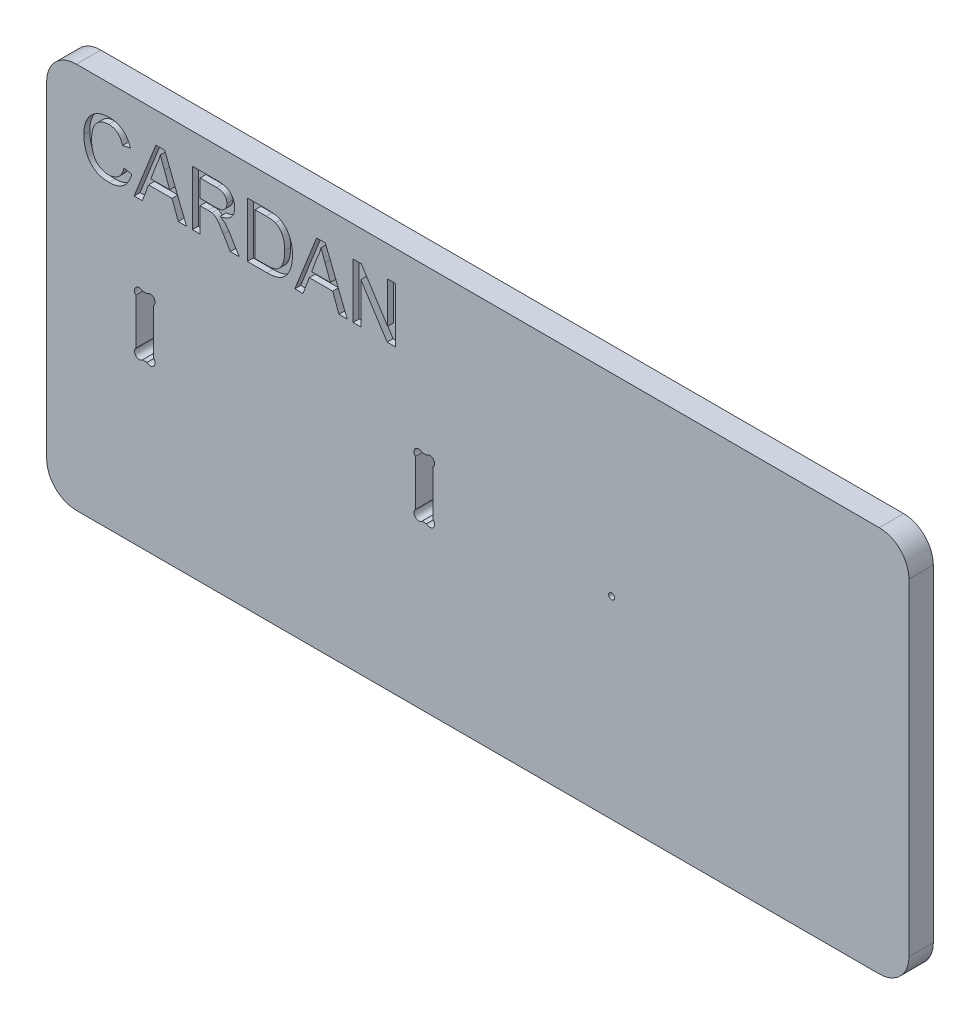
from build123d import *

# Parameters (mm, degrees)
EXTRUSION1_DEPTH        = 8.2
ESQUISSE2_R             = 1
ENL_V_MAT_EXTRU_1_DEPTH = 2


with BuildPart() as part:
    # Esquisse1 → Extrusion1 (new body)
    with BuildSketch(Plane.XY):
        with BuildLine():
            Line((10, 165), (280, 165))
            ThreePointArc((280, 165), (287.071067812, 162.071067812), (290, 155))
            Line((290, 155), (290, 45))
            ThreePointArc((290, 45), (287.071067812, 37.928932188), (280, 35))
            Line((280, 35), (10, 35))
            ThreePointArc((10, 35), (2.928932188, 37.928932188), (0, 45))
            Line((0, 45), (0, 155))
            ThreePointArc((0, 155), (2.928932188, 162.071067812), (10, 165))
        make_face()
        with BuildLine():
            Line((127.7372583, 90), (126.2627417, 90))
            ThreePointArc((126.2627417, 90), (124, 90), (124, 92.2627417))
            Line((124, 92.2627417), (124, 107.7372583))
            ThreePointArc((124, 107.7372583), (124, 110), (126.2627417, 110))
            Line((126.2627417, 110), (127.7372583, 110))
            ThreePointArc((127.7372583, 110), (130, 110), (130, 107.7372583))
            Line((130, 107.7372583), (130, 92.2627417))
            ThreePointArc((130, 92.2627417), (130, 90), (127.7372583, 90))
        make_face(mode=Mode.SUBTRACT)
        with BuildLine():
            Line((32.2627417, 110), (33.7372583, 110))
            ThreePointArc((33.7372583, 110), (36, 110), (36, 107.7372583))
            Line((36, 107.7372583), (36, 92.2627417))
            ThreePointArc((36, 92.2627417), (36, 90), (33.7372583, 90))
            Line((33.7372583, 90), (32.2627417, 90))
            ThreePointArc((32.2627417, 90), (30, 90), (30, 92.2627417))
            Line((30, 92.2627417), (30, 107.7372583))
            ThreePointArc((30, 107.7372583), (30, 110), (32.2627417, 110))
        make_face(mode=Mode.SUBTRACT)
    extrude(amount=EXTRUSION1_DEPTH)

    # Esquisse2 → Enl_v. mat.-Extru.1 (cut)
    # profile 1 of 7: a face of its own
    with BuildSketch(Plane.XY.offset(8.2)):
        with Locations((190, 100)):
            Circle(ESQUISSE2_R)
    # profile 2 of 7: a face of its own
    with BuildSketch(Plane.XY.offset(8.2)):
        with BuildLine():
            Line((26.000996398, 142.805266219), (28.608827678, 142.197760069))
            add(Edge.make_bspline(
                [(28.608827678, 142.197760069), (28.543494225, 141.953335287), (28.415693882, 141.475210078), (28.163017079, 140.790959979), (27.879418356, 140.148820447), (27.558016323, 139.550482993), (27.195293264, 138.999387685), (26.800859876, 138.488451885), (26.359093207, 138.028390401), (25.886202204, 137.608585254), (25.378504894, 137.238318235), (24.842122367, 136.918585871), (24.279647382, 136.646558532), (23.688806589, 136.422859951), (23.069216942, 136.25450759), (22.424068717, 136.131802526), (21.751480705, 136.056223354), (21.293021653, 136.046273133), (21.059452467, 136.041203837)],
                knots=[0, 0, 0, 0, 1.145254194, 2.240259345, 3.299159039, 4.322497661, 5.312016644, 6.284080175, 7.241264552, 8.196044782, 9.144516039, 10.082428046, 11.020306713, 11.970622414, 12.939253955, 13.924100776, 14.94240044, 16, 16, 16, 16], degree=3))
            add(Edge.make_bspline(
                [(21.059452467, 136.041203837), (20.819805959, 136.04468547), (20.350956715, 136.051497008), (19.664119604, 136.106900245), (19.010870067, 136.202988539), (18.392428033, 136.336489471), (17.8067119, 136.501555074), (17.256150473, 136.70922223), (16.741708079, 136.957992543), (16.259093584, 137.240908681), (15.810356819, 137.562314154), (15.38529335, 137.913535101), (14.994222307, 138.304240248), (14.627365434, 138.725204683), (14.292713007, 139.181981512), (13.977953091, 139.668365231), (13.698448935, 140.192925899), (13.443842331, 140.745938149), (13.220368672, 141.322047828), (13.022672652, 141.909875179), (12.861045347, 142.510591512), (12.721894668, 143.119141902), (12.620808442, 143.740646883), (12.540549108, 144.370443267), (12.496420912, 145.012392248), (12.490614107, 145.443905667), (12.487688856, 145.661285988)],
                knots=[0, 0, 0, 0, 1.180702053, 2.309949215, 3.392367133, 4.431746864, 5.425408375, 6.388154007, 7.326956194, 8.237882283, 9.141054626, 10.043899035, 10.951650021, 11.86168169, 12.792564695, 13.739356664, 14.713891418, 15.718426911, 16.737522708, 17.757217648, 18.772674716, 19.801476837, 20.831699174, 21.873853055, 22.928926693, 24, 24, 24, 24], degree=3))
            add(Edge.make_bspline(
                [(12.487688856, 145.661285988), (12.491872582, 145.89595681), (12.500138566, 146.359607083), (12.546799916, 147.043736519), (12.632499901, 147.704005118), (12.751512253, 148.34084719), (12.90211049, 148.954778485), (13.088007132, 149.546098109), (13.306850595, 150.114049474), (13.557973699, 150.659258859), (13.843044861, 151.175640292), (14.153555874, 151.66392785), (14.496913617, 152.116104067), (14.862938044, 152.540807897), (15.260770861, 152.930967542), (15.689197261, 153.287466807), (16.144520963, 153.613557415), (16.626675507, 153.906212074), (17.129358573, 154.163001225), (17.645103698, 154.39172556), (18.17596222, 154.579196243), (18.717725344, 154.73507058), (19.271559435, 154.859161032), (19.838758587, 154.942140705), (20.418798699, 154.996216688), (20.809907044, 155.003545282), (21.007592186, 155.00724951)],
                knots=[0, 0, 0, 0, 1.185634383, 2.342514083, 3.462112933, 4.547331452, 5.613960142, 6.653690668, 7.676612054, 8.686959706, 9.683658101, 10.654407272, 11.607580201, 12.5494388, 13.484601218, 14.419076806, 15.362504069, 16.311442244, 17.265594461, 18.212500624, 19.159571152, 20.107257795, 21.059246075, 22.024387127, 23.001429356, 24, 24, 24, 24], degree=3))
            add(Edge.make_bspline(
                [(21.007592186, 155.00724951), (21.228775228, 155.003080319), (21.663532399, 154.994885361), (22.301461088, 154.927480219), (22.912430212, 154.814583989), (23.499087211, 154.666474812), (24.055332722, 154.463682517), (24.587205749, 154.222585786), (25.08941521, 153.932937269), (25.565868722, 153.60269703), (26.008810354, 153.23125603), (26.424438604, 152.827487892), (26.795806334, 152.381301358), (27.137621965, 151.903494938), (27.439130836, 151.387443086), (27.711425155, 150.837645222), (27.945590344, 150.250014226), (28.070880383, 149.840712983), (28.134676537, 149.6323018)],
                knots=[0, 0, 0, 0, 1.098391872, 2.158997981, 3.181470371, 4.182549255, 5.160268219, 6.118029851, 7.079534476, 8.035645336, 8.993622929, 9.94770573, 10.909620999, 11.872786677, 12.862530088, 13.874594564, 14.917769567, 16, 16, 16, 16], degree=3))
            Line((28.134676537, 149.6323018), (25.526845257, 149.072951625))
            add(Edge.make_bspline(
                [(25.526845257, 149.072951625), (25.475631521, 149.232896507), (25.375390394, 149.545958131), (25.197402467, 149.992126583), (25.00518144, 150.406316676), (24.794148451, 150.785712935), (24.563846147, 151.130406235), (24.319577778, 151.444585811), (24.055490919, 151.722387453), (23.776957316, 151.970216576), (23.476784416, 152.181343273), (23.162009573, 152.368436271), (22.825995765, 152.523227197), (22.473576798, 152.654148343), (22.101458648, 152.753793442), (21.71115663, 152.8238977), (21.302327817, 152.86447061), (21.023733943, 152.870496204), (20.881645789, 152.873569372)],
                knots=[0, 0, 0, 0, 1.235697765, 2.418642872, 3.532555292, 4.594392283, 5.610119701, 6.580908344, 7.519430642, 8.427315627, 9.319973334, 10.216139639, 11.118687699, 12.038725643, 12.980015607, 13.949697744, 14.954307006, 16, 16, 16, 16], degree=3))
            add(Edge.make_bspline(
                [(20.881645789, 152.873569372), (20.71851559, 152.871202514), (20.397686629, 152.866547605), (19.92635029, 152.815600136), (19.473703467, 152.740559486), (19.04311972, 152.62802958), (18.632242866, 152.487734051), (18.243511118, 152.313041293), (17.873617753, 152.10828089), (17.526690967, 151.872223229), (17.205646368, 151.606848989), (16.901771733, 151.326306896), (16.629656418, 151.017513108), (16.378923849, 150.690649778), (16.15687535, 150.339940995), (15.956994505, 149.970163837), (15.7805554, 149.57828769), (15.588224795, 149.026751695), (15.392117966, 148.316386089), (15.221995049, 147.44712883), (15.113630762, 146.564176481), (15.101569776, 145.97028664), (15.095520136, 145.672398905)],
                knots=[0, 0, 0, 0, 0.935256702, 1.839373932, 2.716087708, 3.564631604, 4.388828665, 5.203538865, 6.005592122, 6.810952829, 7.606223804, 8.392839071, 9.180346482, 9.963639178, 10.753404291, 11.558266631, 12.372976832, 13.215232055, 14.905983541, 16.594894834, 18.292041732, 20, 20, 20, 20], degree=3))
            add(Edge.make_bspline(
                [(15.095520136, 145.672398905), (15.102343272, 145.29785493), (15.115580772, 144.5712057), (15.246202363, 143.518170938), (15.44535289, 142.53597295), (15.685698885, 141.769662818), (15.926790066, 141.204418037), (16.1217725, 140.808568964), (16.344337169, 140.442269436), (16.58894808, 140.103439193), (16.858756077, 139.793066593), (17.150002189, 139.509502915), (17.462751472, 139.250019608), (17.800709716, 139.026763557), (18.150868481, 138.828531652), (18.508809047, 138.652260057), (18.874756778, 138.503177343), (19.250188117, 138.387366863), (19.629831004, 138.287290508), (20.017866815, 138.221915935), (20.414184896, 138.185020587), (20.680302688, 138.178289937), (20.814968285, 138.174883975)],
                knots=[0, 0, 0, 0, 2.10686522, 4.087509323, 5.961373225, 7.741398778, 8.594514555, 9.418024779, 10.222433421, 11.003575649, 11.767087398, 12.533660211, 13.289033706, 14.050297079, 14.809623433, 15.552362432, 16.294320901, 17.0305302, 17.761969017, 18.502233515, 19.242073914, 20, 20, 20, 20], degree=3))
            add(Edge.make_bspline(
                [(20.814968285, 138.174883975), (20.975673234, 138.178254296), (21.293122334, 138.184911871), (21.758543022, 138.243186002), (22.207202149, 138.329060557), (22.633664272, 138.461573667), (23.04366579, 138.623820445), (23.433847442, 138.823899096), (23.802982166, 139.064535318), (24.1554118, 139.337755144), (24.484637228, 139.648632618), (24.786354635, 139.994663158), (25.057029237, 140.377424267), (25.308012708, 140.790773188), (25.518884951, 141.247058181), (25.71420244, 141.732679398), (25.87695508, 142.255618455), (25.959055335, 142.619418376), (26.000996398, 142.805266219)],
                knots=[0, 0, 0, 0, 1.013374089, 2.001772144, 2.95501459, 3.891367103, 4.814208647, 5.733921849, 6.652182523, 7.590185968, 8.54346024, 9.504121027, 10.481158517, 11.497760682, 12.549996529, 13.647863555, 14.798406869, 16, 16, 16, 16], degree=3))
        make_face()
    # profile 3 of 7: a face of its own
    with BuildSketch(Plane.XY.offset(8.2)):
        Polygon((29.397844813, 136.278279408), (36.7397789, 154.770173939), (39.680997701, 154.770173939), (47.022931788, 136.278279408), (44.255815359, 136.278279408), (42.151769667, 141.96809311), (34.269006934, 141.96809311), (32.164961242, 136.278279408), align=None)
        with BuildLine():
            Line((35.054319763, 144.101773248), (41.366456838, 144.101773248))
            Line((41.366456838, 144.101773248), (39.569868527, 148.961822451))
            add(Edge.make_bspline(
                [(39.569868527, 148.961822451), (39.500993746, 149.14960813), (39.366330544, 149.516764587), (39.165507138, 150.050211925), (38.982038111, 150.556795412), (38.802131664, 151.029251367), (38.639726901, 151.474442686), (38.490034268, 151.889362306), (38.341989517, 152.271126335), (38.25314578, 152.517785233), (38.2103883, 152.636493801)],
                knots=[0, 0, 0, 0, 1.225184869, 2.395467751, 3.491410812, 4.525364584, 5.492066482, 6.394148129, 7.227157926, 8, 8, 8, 8], degree=3))
            add(Edge.make_bspline(
                [(38.2103883, 152.636493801), (38.139659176, 152.343768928), (37.99790929, 151.757112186), (37.701119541, 150.897581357), (37.361602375, 150.045911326), (37.08587398, 149.497100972), (36.947220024, 149.221123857)],
                knots=[0, 0, 0, 0, 0.9891762, 1.982431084, 2.985436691, 4, 4, 4, 4], degree=3))
            Line((36.947220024, 149.221123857), (35.054319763, 144.101773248))
        make_face(mode=Mode.SUBTRACT)
    # profile 4 of 7: a face of its own
    with BuildSketch(Plane.XY.offset(8.2)):
        with BuildLine():
            Line((48.997326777, 136.278279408), (48.997326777, 154.770173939))
            Line((48.997326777, 154.770173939), (57.02085313, 154.770173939))
            add(Edge.make_bspline(
                [(57.02085313, 154.770173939), (57.209782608, 154.768693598), (57.575433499, 154.765828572), (58.105702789, 154.745547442), (58.600656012, 154.701826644), (59.061203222, 154.654548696), (59.487262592, 154.581983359), (59.878394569, 154.498752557), (60.23520304, 154.399706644), (60.559283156, 154.282725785), (60.859958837, 154.150379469), (61.138662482, 153.987085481), (61.406979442, 153.808150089), (61.654951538, 153.597927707), (61.889119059, 153.367753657), (62.109264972, 153.114500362), (62.31213019, 152.835970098), (62.562340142, 152.437335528), (62.830764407, 151.906438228), (63.054403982, 151.227004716), (63.198602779, 150.516292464), (63.214032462, 150.030602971), (63.221861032, 149.784178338)],
                knots=[0, 0, 0, 0, 1.242255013, 2.404239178, 3.487702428, 4.508875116, 5.447164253, 6.327763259, 7.137389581, 7.87956647, 8.591787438, 9.293660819, 10.000726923, 10.709654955, 11.427269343, 12.158170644, 12.913245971, 13.690346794, 15.251572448, 16.809945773, 18.381459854, 20, 20, 20, 20], degree=3))
            add(Edge.make_bspline(
                [(63.221861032, 149.784178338), (63.218242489, 149.6259957), (63.21109562, 149.313574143), (63.15634988, 148.854230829), (63.057291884, 148.415346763), (62.930269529, 147.993078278), (62.756414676, 147.593408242), (62.555011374, 147.208173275), (62.305501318, 146.847956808), (62.026147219, 146.503166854), (61.70580298, 146.181187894), (61.34165054, 145.893636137), (60.937299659, 145.634982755), (60.490846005, 145.412364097), (60.00742871, 145.208880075), (59.480982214, 145.045024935), (58.913631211, 144.911224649), (58.520317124, 144.846433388), (58.317360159, 144.81299996)],
                knots=[0, 0, 0, 0, 0.982609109, 1.940720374, 2.867584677, 3.775009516, 4.675469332, 5.571146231, 6.471115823, 7.392408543, 8.32534739, 9.286126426, 10.269214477, 11.301811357, 12.381622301, 13.524260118, 14.722474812, 16, 16, 16, 16], degree=3))
            add(Edge.make_bspline(
                [(58.317360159, 144.81299996), (58.466236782, 144.737790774), (58.748958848, 144.594965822), (59.140391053, 144.371017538), (59.472194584, 144.142197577), (59.664425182, 143.978538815), (59.754630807, 143.901740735)],
                knots=[0, 0, 0, 0, 1.172304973, 2.226249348, 3.167654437, 4, 4, 4, 4], degree=3))
            add(Edge.make_bspline(
                [(59.754630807, 143.901740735), (59.929319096, 143.730495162), (60.288141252, 143.378744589), (60.782613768, 142.779610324), (61.262021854, 142.112681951), (61.553298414, 141.630690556), (61.703095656, 141.382812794)],
                knots=[0, 0, 0, 0, 0.918110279, 1.885863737, 2.912745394, 4, 4, 4, 4], degree=3))
            Line((61.703095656, 141.382812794), (64.736922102, 136.278279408))
            Line((64.736922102, 136.278279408), (61.747547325, 136.278279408))
            Line((61.747547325, 136.278279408), (59.44346912, 140.182617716))
            add(Edge.make_bspline(
                [(59.44346912, 140.182617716), (59.360626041, 140.319606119), (59.200089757, 140.585067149), (58.968200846, 140.972760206), (58.740841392, 141.329693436), (58.529969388, 141.666068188), (58.327027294, 141.975777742), (58.133976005, 142.259897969), (57.956128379, 142.522156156), (57.735841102, 142.827492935), (57.479463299, 143.165350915), (57.180287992, 143.513280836), (56.895384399, 143.790680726), (56.544520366, 144.062700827), (56.109922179, 144.317129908), (55.740505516, 144.434033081), (55.561356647, 144.490725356)],
                knots=[0, 0, 0, 0, 1.130940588, 2.191577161, 3.191089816, 4.120344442, 4.99615009, 5.80661983, 6.546979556, 7.234477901, 8.466216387, 9.541989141, 10.473533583, 11.269175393, 12.675684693, 14, 14, 14, 14], degree=3))
            add(Edge.make_bspline(
                [(55.561356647, 144.490725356), (55.486192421, 144.504280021), (55.31459024, 144.535225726), (55.023210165, 144.555436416), (54.670167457, 144.576887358), (54.41431139, 144.57626235), (54.275962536, 144.57592439)],
                knots=[0, 0, 0, 0, 0.709978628, 1.620902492, 2.713552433, 4, 4, 4, 4], degree=3))
            Line((54.275962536, 144.57592439), (51.605158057, 144.57592439))
            Line((51.605158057, 144.57592439), (51.605158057, 136.278279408))
            Line((51.605158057, 136.278279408), (48.997326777, 136.278279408))
        make_face()
        with BuildLine():
            Line((51.605158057, 146.709604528), (56.557814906, 146.709604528))
            add(Edge.make_bspline(
                [(56.557814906, 146.709604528), (56.80615988, 146.71349012), (57.270417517, 146.720753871), (57.919608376, 146.78277867), (58.472863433, 146.88133871), (58.941119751, 147.02510007), (59.334528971, 147.224688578), (59.676684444, 147.467924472), (59.961019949, 147.772602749), (60.197557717, 148.116367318), (60.381423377, 148.494663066), (60.514055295, 148.892007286), (60.600865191, 149.305060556), (60.609602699, 149.586178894), (60.614029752, 149.728613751)],
                knots=[0, 0, 0, 0, 1.546323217, 2.890706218, 4.056530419, 5.041445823, 5.928701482, 6.793137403, 7.641659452, 8.509781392, 9.383301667, 10.251423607, 11.114044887, 12, 12, 12, 12], degree=3))
            add(Edge.make_bspline(
                [(60.614029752, 149.728613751), (60.610587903, 149.832411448), (60.603846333, 150.035720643), (60.568504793, 150.334122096), (60.499792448, 150.617672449), (60.409057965, 150.887870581), (60.287818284, 151.142737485), (60.143790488, 151.384248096), (59.971920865, 151.611063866), (59.775054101, 151.82387571), (59.54901528, 152.017513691), (59.290825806, 152.18458127), (59.002522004, 152.326552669), (58.683768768, 152.439230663), (58.335570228, 152.529354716), (57.955944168, 152.589311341), (57.546626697, 152.632695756), (57.262993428, 152.635204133), (57.117165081, 152.636493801)],
                knots=[0, 0, 0, 0, 0.965208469, 1.890559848, 2.786986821, 3.67262109, 4.535197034, 5.405224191, 6.282113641, 7.175449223, 8.095446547, 9.040936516, 10.026471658, 11.075712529, 12.17809725, 13.364958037, 14.645208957, 16, 16, 16, 16], degree=3))
            Line((57.117165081, 152.636493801), (51.605158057, 152.636493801))
            Line((51.605158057, 152.636493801), (51.605158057, 146.709604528))
        make_face(mode=Mode.SUBTRACT)
    # profile 5 of 7: a face of its own
    with BuildSketch(Plane.XY.offset(8.2)):
        with BuildLine():
            Line((67.489221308, 136.278279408), (67.489221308, 154.770173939))
            Line((67.489221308, 154.770173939), (73.812471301, 154.770173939))
            add(Edge.make_bspline(
                [(73.812471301, 154.770173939), (73.985340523, 154.769392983), (74.321238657, 154.767875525), (74.809164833, 154.758204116), (75.266042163, 154.734876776), (75.689765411, 154.70646099), (76.082471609, 154.668627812), (76.443659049, 154.6263209), (76.773609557, 154.571137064), (76.981053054, 154.525269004), (77.079669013, 154.503463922)],
                knots=[0, 0, 0, 0, 1.263127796, 2.454354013, 3.565393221, 4.605443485, 5.557051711, 6.447822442, 7.26211484, 8, 8, 8, 8], degree=3))
            add(Edge.make_bspline(
                [(77.079669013, 154.503463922), (77.334706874, 154.436551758), (77.83575367, 154.305096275), (78.543033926, 154.009404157), (79.192347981, 153.638512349), (79.577432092, 153.333004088), (79.76899502, 153.181026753)],
                knots=[0, 0, 0, 0, 1.04477941, 2.052571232, 3.03123721, 4, 4, 4, 4], degree=3))
            add(Edge.make_bspline(
                [(79.76899502, 153.181026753), (79.887935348, 153.076577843), (80.126354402, 152.867207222), (80.453821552, 152.522253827), (80.757607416, 152.156314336), (81.046785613, 151.775688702), (81.302860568, 151.366500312), (81.542894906, 150.940526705), (81.752262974, 150.489213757), (81.944983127, 150.019937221), (82.116683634, 149.530868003), (82.257763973, 149.022321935), (82.387371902, 148.49960946), (82.483770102, 147.957016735), (82.567920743, 147.399146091), (82.621341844, 146.822804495), (82.656003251, 146.229712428), (82.660019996, 145.828031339), (82.662057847, 145.62424293)],
                knots=[0, 0, 0, 0, 0.908997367, 1.822109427, 2.728529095, 3.640759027, 4.565643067, 5.499218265, 6.448003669, 7.421473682, 8.413047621, 9.423472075, 10.452328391, 11.505545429, 12.587978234, 13.692612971, 14.829372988, 16, 16, 16, 16], degree=3))
            add(Edge.make_bspline(
                [(82.662057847, 145.62424293), (82.657090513, 145.283207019), (82.647424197, 144.619559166), (82.55182802, 143.654295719), (82.403901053, 142.746979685), (82.18861429, 141.90305921), (81.923466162, 141.12721498), (81.634212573, 140.413110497), (81.301261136, 139.773050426), (80.936020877, 139.201624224), (80.54467562, 138.695216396), (80.134695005, 138.24622663), (79.70486372, 137.854456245), (79.257365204, 137.50962362), (78.768958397, 137.224092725), (78.244767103, 136.967710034), (77.667784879, 136.761706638), (77.048877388, 136.581510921), (76.380775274, 136.446512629), (75.667096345, 136.34731154), (74.905035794, 136.287323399), (74.381810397, 136.281352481), (74.112520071, 136.278279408)],
                knots=[0, 0, 0, 0, 1.410753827, 2.745293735, 4.009435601, 5.211453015, 6.344066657, 7.400119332, 8.396481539, 9.324811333, 10.202671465, 11.041621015, 11.837259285, 12.606727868, 13.374311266, 14.17412185, 15.017911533, 15.905707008, 16.839601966, 17.835295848, 18.885883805, 20, 20, 20, 20], degree=3))
            Line((74.112520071, 136.278279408), (67.489221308, 136.278279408))
        make_face()
        with BuildLine():
            Line((70.097052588, 138.411959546), (73.908783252, 138.411959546))
            add(Edge.make_bspline(
                [(73.908783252, 138.411959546), (74.186725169, 138.416120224), (74.712529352, 138.423991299), (75.454356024, 138.484440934), (76.101799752, 138.588708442), (76.662039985, 138.737052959), (77.148135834, 138.9288852), (77.576145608, 139.15567673), (77.956865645, 139.413034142), (78.171325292, 139.618930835), (78.276159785, 139.719579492)],
                knots=[0, 0, 0, 0, 1.423649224, 2.693227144, 3.808972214, 4.778671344, 5.656058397, 6.479437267, 7.256702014, 8, 8, 8, 8], degree=3))
            add(Edge.make_bspline(
                [(78.276159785, 139.719579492), (78.41258096, 139.875566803), (78.692836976, 140.196018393), (79.0418284, 140.755830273), (79.346165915, 141.385725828), (79.600574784, 142.092410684), (79.809183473, 142.873494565), (79.94831751, 143.735973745), (80.039284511, 144.673983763), (80.04912185, 145.326428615), (80.054226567, 145.664990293)],
                knots=[0, 0, 0, 0, 0.782184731, 1.606876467, 2.483531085, 3.422528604, 4.441347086, 5.534669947, 6.720709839, 8, 8, 8, 8], degree=3))
            add(Edge.make_bspline(
                [(80.054226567, 145.664990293), (80.051063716, 145.900870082), (80.044915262, 146.359410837), (80.006584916, 147.027427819), (79.930915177, 147.652624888), (79.83414066, 148.236083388), (79.702010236, 148.775948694), (79.55091681, 149.277393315), (79.3608361, 149.733862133), (79.143930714, 150.1488791), (78.905982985, 150.525200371), (78.658032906, 150.870909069), (78.398811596, 151.184871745), (78.122826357, 151.462621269), (77.838373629, 151.712371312), (77.540150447, 151.929008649), (77.228991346, 152.112466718), (77.010341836, 152.207701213), (76.901862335, 152.254950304)],
                knots=[0, 0, 0, 0, 1.460126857, 2.838427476, 4.139102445, 5.35666337, 6.496721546, 7.577303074, 8.594995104, 9.55219858, 10.472533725, 11.348579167, 12.184287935, 12.989560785, 13.769667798, 14.524891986, 15.268148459, 16, 16, 16, 16], degree=3))
            add(Edge.make_bspline(
                [(76.901862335, 152.254950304), (76.817100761, 152.285969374), (76.637496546, 152.351696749), (76.344365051, 152.426090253), (76.017227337, 152.494552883), (75.652858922, 152.542604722), (75.253102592, 152.589305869), (74.815473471, 152.617685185), (74.342266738, 152.630545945), (74.014979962, 152.634467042), (73.845810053, 152.636493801)],
                knots=[0, 0, 0, 0, 0.699400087, 1.48198292, 2.341906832, 3.289648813, 4.329964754, 5.462247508, 6.688271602, 8, 8, 8, 8], degree=3))
            Line((73.845810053, 152.636493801), (70.097052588, 152.636493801))
            Line((70.097052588, 152.636493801), (70.097052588, 138.411959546))
        make_face(mode=Mode.SUBTRACT)
    # profile 6 of 7: a face of its own
    with BuildSketch(Plane.XY.offset(8.2)):
        Polygon((83.451074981, 136.278279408), (90.793009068, 154.770173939), (93.73422787, 154.770173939), (101.076161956, 136.278279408), (98.309045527, 136.278279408), (96.204999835, 141.96809311), (88.322237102, 141.96809311), (86.21819141, 136.278279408), align=None)
        with BuildLine():
            Line((89.107549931, 144.101773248), (95.419687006, 144.101773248))
            Line((95.419687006, 144.101773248), (93.623098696, 148.961822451))
            add(Edge.make_bspline(
                [(93.623098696, 148.961822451), (93.554223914, 149.14960813), (93.419560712, 149.516764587), (93.218737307, 150.050211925), (93.03526828, 150.556795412), (92.855361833, 151.029251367), (92.69295707, 151.474442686), (92.543264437, 151.889362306), (92.395219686, 152.271126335), (92.306375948, 152.517785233), (92.263618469, 152.636493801)],
                knots=[0, 0, 0, 0, 1.225184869, 2.395467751, 3.491410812, 4.525364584, 5.492066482, 6.394148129, 7.227157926, 8, 8, 8, 8], degree=3))
            add(Edge.make_bspline(
                [(92.263618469, 152.636493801), (92.192889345, 152.343768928), (92.051139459, 151.757112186), (91.754349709, 150.897581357), (91.414832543, 150.045911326), (91.139104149, 149.497100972), (91.000450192, 149.221123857)],
                knots=[0, 0, 0, 0, 0.9891762, 1.982431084, 2.985436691, 4, 4, 4, 4], degree=3))
            Line((91.000450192, 149.221123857), (89.107549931, 144.101773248))
        make_face(mode=Mode.SUBTRACT)
    # profile 7 of 7: a face of its own
    with BuildSketch(Plane.XY.offset(8.2)):
        Polygon((103.050556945, 136.278279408), (103.050556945, 154.770173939), (105.806560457, 154.770173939), (114.66725992, 140.971634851), (114.66725992, 154.770173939), (117.2750912, 154.770173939), (117.2750912, 136.278279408), (114.519087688, 136.278279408), (105.658388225, 150.076818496), (105.658388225, 136.278279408), align=None)
    extrude(amount=-ENL_V_MAT_EXTRU_1_DEPTH, mode=Mode.SUBTRACT)


solid = part.part
